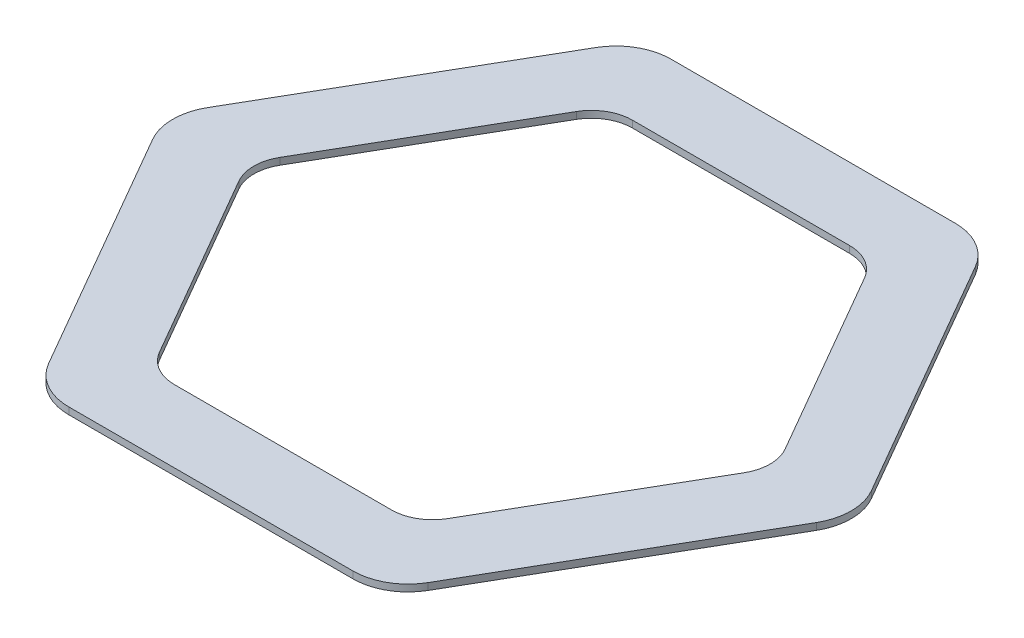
ISO-10303-21;
HEADER;
FILE_DESCRIPTION(('STEP AP214'),'2;1');
FILE_NAME('part.step','',(''),(''),'','','');
FILE_SCHEMA(('AUTOMOTIVE_DESIGN { 1 0 10303 214 1 1 1 1 }'));
ENDSEC;
DATA;
#1=APPLICATION_CONTEXT('core data for automotive mechanical design processes');
#2=APPLICATION_PROTOCOL_DEFINITION('international standard','automotive_design',2000,#1);
#3=PRODUCT_CONTEXT('',#1,'mechanical');
#4=PRODUCT('Part','Part','',(#3));
#5=PRODUCT_RELATED_PRODUCT_CATEGORY('part','',(#4));
#6=PRODUCT_DEFINITION_FORMATION('','',#4);
#7=PRODUCT_DEFINITION_CONTEXT('part definition',#1,'design');
#8=PRODUCT_DEFINITION('design','',#6,#7);
#9=PRODUCT_DEFINITION_SHAPE('','',#8);
#10=(LENGTH_UNIT() NAMED_UNIT(*) SI_UNIT(.MILLI.,.METRE.));
#11=(NAMED_UNIT(*) PLANE_ANGLE_UNIT() SI_UNIT($,.RADIAN.));
#12=(NAMED_UNIT(*) SI_UNIT($,.STERADIAN.) SOLID_ANGLE_UNIT());
#13=UNCERTAINTY_MEASURE_WITH_UNIT(LENGTH_MEASURE(1.E-05),#10,'distance_accuracy_value','');
#14=(GEOMETRIC_REPRESENTATION_CONTEXT(3) GLOBAL_UNCERTAINTY_ASSIGNED_CONTEXT((#13)) GLOBAL_UNIT_ASSIGNED_CONTEXT((#10,
#11,#12)) REPRESENTATION_CONTEXT('',''));
#15=CARTESIAN_POINT('',(0.,0.,0.));
#16=DIRECTION('',(0.,0.,1.));
#17=DIRECTION('',(1.,0.,0.));
#18=AXIS2_PLACEMENT_3D('',#15,#16,#17);
#19=CARTESIAN_POINT('',(-41.569219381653,2.,-72.));
#20=DIRECTION('',(0.,1.,0.));
#21=DIRECTION('',(0.,0.,1.));
#22=AXIS2_PLACEMENT_3D('',#19,#20,#21);
#23=PLANE('',#22);
#24=CARTESIAN_POINT('',(-41.569219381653,2.,-72.));
#25=DIRECTION('',(0.,1.,0.));
#26=DIRECTION('',(0.,0.,1.));
#27=AXIS2_PLACEMENT_3D('',#24,#25,#26);
#28=CIRCLE('',#27,16.1);
#29=CARTESIAN_POINT('',(-41.569219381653,2.,-88.1));
#30=VERTEX_POINT('',#29);
#31=CARTESIAN_POINT('',(-55.5122283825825,2.,-80.05));
#32=VERTEX_POINT('',#31);
#33=EDGE_CURVE('E293',#30,#32,#28,.T.);
#34=ORIENTED_EDGE('',*,*,#33,.T.);
#35=DIRECTION('',(-0.5,0.,0.866025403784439));
#36=VECTOR('',#35,1.);
#37=CARTESIAN_POINT('',(-55.5122283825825,2.,-80.05));
#38=LINE('',#37,#36);
#39=CARTESIAN_POINT('',(-97.0814477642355,2.,-8.04999999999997));
#40=VERTEX_POINT('',#39);
#41=EDGE_CURVE('E296',#32,#40,#38,.T.);
#42=ORIENTED_EDGE('',*,*,#41,.T.);
#43=CARTESIAN_POINT('',(-83.1384387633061,2.,0.));
#44=DIRECTION('',(0.,1.,0.));
#45=DIRECTION('',(0.,0.,1.));
#46=AXIS2_PLACEMENT_3D('',#43,#44,#45);
#47=CIRCLE('',#46,16.1);
#48=CARTESIAN_POINT('',(-97.0814477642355,2.,8.05000000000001));
#49=VERTEX_POINT('',#48);
#50=EDGE_CURVE('E299',#40,#49,#47,.T.);
#51=ORIENTED_EDGE('',*,*,#50,.T.);
#52=DIRECTION('',(0.5,0.,0.866025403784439));
#53=VECTOR('',#52,1.);
#54=CARTESIAN_POINT('',(-97.0814477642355,2.,8.05000000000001));
#55=LINE('',#54,#53);
#56=CARTESIAN_POINT('',(-55.5122283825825,2.,80.05));
#57=VERTEX_POINT('',#56);
#58=EDGE_CURVE('E301',#49,#57,#55,.T.);
#59=ORIENTED_EDGE('',*,*,#58,.T.);
#60=CARTESIAN_POINT('',(-41.569219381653,2.,72.));
#61=DIRECTION('',(0.,1.,0.));
#62=DIRECTION('',(0.,0.,1.));
#63=AXIS2_PLACEMENT_3D('',#60,#61,#62);
#64=CIRCLE('',#63,16.1);
#65=CARTESIAN_POINT('',(-41.569219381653,2.,88.1));
#66=VERTEX_POINT('',#65);
#67=EDGE_CURVE('E303',#57,#66,#64,.T.);
#68=ORIENTED_EDGE('',*,*,#67,.T.);
#69=DIRECTION('',(1.,0.,0.));
#70=VECTOR('',#69,1.);
#71=CARTESIAN_POINT('',(-41.569219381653,2.,88.1));
#72=LINE('',#71,#70);
#73=CARTESIAN_POINT('',(41.569219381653,2.,88.1));
#74=VERTEX_POINT('',#73);
#75=EDGE_CURVE('E305',#66,#74,#72,.T.);
#76=ORIENTED_EDGE('',*,*,#75,.T.);
#77=CARTESIAN_POINT('',(41.569219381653,2.,72.));
#78=DIRECTION('',(0.,1.,0.));
#79=DIRECTION('',(0.,0.,1.));
#80=AXIS2_PLACEMENT_3D('',#77,#78,#79);
#81=CIRCLE('',#80,16.1);
#82=CARTESIAN_POINT('',(55.5122283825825,2.,80.05));
#83=VERTEX_POINT('',#82);
#84=EDGE_CURVE('E307',#74,#83,#81,.T.);
#85=ORIENTED_EDGE('',*,*,#84,.T.);
#86=DIRECTION('',(0.5,0.,-0.866025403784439));
#87=VECTOR('',#86,1.);
#88=CARTESIAN_POINT('',(55.5122283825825,2.,80.05));
#89=LINE('',#88,#87);
#90=CARTESIAN_POINT('',(97.0814477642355,2.,8.0499999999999));
#91=VERTEX_POINT('',#90);
#92=EDGE_CURVE('E309',#83,#91,#89,.T.);
#93=ORIENTED_EDGE('',*,*,#92,.T.);
#94=CARTESIAN_POINT('',(83.1384387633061,2.,0.));
#95=DIRECTION('',(0.,1.,0.));
#96=DIRECTION('',(0.,0.,-1.));
#97=AXIS2_PLACEMENT_3D('',#94,#95,#96);
#98=CIRCLE('',#97,16.1);
#99=CARTESIAN_POINT('',(97.0814477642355,2.,-8.05000000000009));
#100=VERTEX_POINT('',#99);
#101=EDGE_CURVE('E311',#91,#100,#98,.T.);
#102=ORIENTED_EDGE('',*,*,#101,.T.);
#103=DIRECTION('',(-0.5,0.,-0.866025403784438));
#104=VECTOR('',#103,1.);
#105=CARTESIAN_POINT('',(97.0814477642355,2.,-8.05000000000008));
#106=LINE('',#105,#104);
#107=CARTESIAN_POINT('',(55.5122283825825,2.,-80.05));
#108=VERTEX_POINT('',#107);
#109=EDGE_CURVE('E313',#100,#108,#106,.T.);
#110=ORIENTED_EDGE('',*,*,#109,.T.);
#111=CARTESIAN_POINT('',(41.569219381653,2.,-72.));
#112=DIRECTION('',(0.,1.,0.));
#113=DIRECTION('',(0.,0.,1.));
#114=AXIS2_PLACEMENT_3D('',#111,#112,#113);
#115=CIRCLE('',#114,16.1);
#116=CARTESIAN_POINT('',(41.569219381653,2.,-88.1));
#117=VERTEX_POINT('',#116);
#118=EDGE_CURVE('E315',#108,#117,#115,.T.);
#119=ORIENTED_EDGE('',*,*,#118,.T.);
#120=DIRECTION('',(-1.,0.,0.));
#121=VECTOR('',#120,1.);
#122=CARTESIAN_POINT('',(41.569219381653,2.,-88.1));
#123=LINE('',#122,#121);
#124=EDGE_CURVE('E317',#117,#30,#123,.T.);
#125=ORIENTED_EDGE('',*,*,#124,.T.);
#126=EDGE_LOOP('',(#34,#42,#51,#59,#68,#76,#85,#93,#102,#110,#119,#125));
#127=FACE_BOUND('',#126,.T.);
#128=DIRECTION('',(-0.5,0.,0.866025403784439));
#129=VECTOR('',#128,1.);
#130=CARTESIAN_POINT('',(-42.1465696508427,2.,-61.));
#131=LINE('',#130,#129);
#132=CARTESIAN_POINT('',(-42.1465696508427,2.,-61.));
#133=VERTEX_POINT('',#132);
#134=CARTESIAN_POINT('',(-73.9008344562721,2.,-5.99999999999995));
#135=VERTEX_POINT('',#134);
#136=EDGE_CURVE('E208',#133,#135,#131,.T.);
#137=ORIENTED_EDGE('',*,*,#136,.F.);
#138=CARTESIAN_POINT('',(-31.7542648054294,2.,-55.));
#139=DIRECTION('',(0.,1.,0.));
#140=DIRECTION('',(0.,0.,1.));
#141=AXIS2_PLACEMENT_3D('',#138,#139,#140);
#142=CIRCLE('',#141,12.);
#143=CARTESIAN_POINT('',(-31.7542648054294,2.,-67.));
#144=VERTEX_POINT('',#143);
#145=EDGE_CURVE('E200',#144,#133,#142,.T.);
#146=ORIENTED_EDGE('',*,*,#145,.F.);
#147=DIRECTION('',(-1.,0.,0.));
#148=VECTOR('',#147,1.);
#149=CARTESIAN_POINT('',(31.7542648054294,2.,-67.));
#150=LINE('',#149,#148);
#151=CARTESIAN_POINT('',(31.7542648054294,2.,-67.));
#152=VERTEX_POINT('',#151);
#153=EDGE_CURVE('E241',#152,#144,#150,.T.);
#154=ORIENTED_EDGE('',*,*,#153,.F.);
#155=CARTESIAN_POINT('',(31.7542648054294,2.,-55.));
#156=DIRECTION('',(0.,1.,0.));
#157=DIRECTION('',(0.,0.,1.));
#158=AXIS2_PLACEMENT_3D('',#155,#156,#157);
#159=CIRCLE('',#158,12.);
#160=CARTESIAN_POINT('',(42.1465696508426,2.,-61.));
#161=VERTEX_POINT('',#160);
#162=EDGE_CURVE('E239',#161,#152,#159,.T.);
#163=ORIENTED_EDGE('',*,*,#162,.F.);
#164=DIRECTION('',(-0.5,0.,-0.866025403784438));
#165=VECTOR('',#164,1.);
#166=CARTESIAN_POINT('',(73.9008344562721,2.,-6.00000000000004));
#167=LINE('',#166,#165);
#168=CARTESIAN_POINT('',(73.9008344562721,2.,-6.00000000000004));
#169=VERTEX_POINT('',#168);
#170=EDGE_CURVE('E237',#169,#161,#167,.T.);
#171=ORIENTED_EDGE('',*,*,#170,.F.);
#172=CARTESIAN_POINT('',(63.5085296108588,2.,0.));
#173=DIRECTION('',(0.,1.,0.));
#174=DIRECTION('',(0.,0.,-1.));
#175=AXIS2_PLACEMENT_3D('',#172,#173,#174);
#176=CIRCLE('',#175,12.);
#177=CARTESIAN_POINT('',(73.9008344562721,2.,5.99999999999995));
#178=VERTEX_POINT('',#177);
#179=EDGE_CURVE('E235',#178,#169,#176,.T.);
#180=ORIENTED_EDGE('',*,*,#179,.F.);
#181=DIRECTION('',(0.499999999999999,0.,-0.866025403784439));
#182=VECTOR('',#181,1.);
#183=CARTESIAN_POINT('',(42.1465696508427,2.,61.));
#184=LINE('',#183,#182);
#185=CARTESIAN_POINT('',(42.1465696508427,2.,61.));
#186=VERTEX_POINT('',#185);
#187=EDGE_CURVE('E233',#186,#178,#184,.T.);
#188=ORIENTED_EDGE('',*,*,#187,.F.);
#189=CARTESIAN_POINT('',(31.7542648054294,2.,55.));
#190=DIRECTION('',(0.,1.,0.));
#191=DIRECTION('',(0.,0.,1.));
#192=AXIS2_PLACEMENT_3D('',#189,#190,#191);
#193=CIRCLE('',#192,12.);
#194=CARTESIAN_POINT('',(31.7542648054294,2.,67.));
#195=VERTEX_POINT('',#194);
#196=EDGE_CURVE('E231',#195,#186,#193,.T.);
#197=ORIENTED_EDGE('',*,*,#196,.F.);
#198=DIRECTION('',(1.,0.,0.));
#199=VECTOR('',#198,1.);
#200=CARTESIAN_POINT('',(-31.7542648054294,2.,67.));
#201=LINE('',#200,#199);
#202=CARTESIAN_POINT('',(-31.7542648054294,2.,67.));
#203=VERTEX_POINT('',#202);
#204=EDGE_CURVE('E229',#203,#195,#201,.T.);
#205=ORIENTED_EDGE('',*,*,#204,.F.);
#206=CARTESIAN_POINT('',(-31.7542648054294,2.,55.));
#207=DIRECTION('',(0.,1.,0.));
#208=DIRECTION('',(0.,0.,1.));
#209=AXIS2_PLACEMENT_3D('',#206,#207,#208);
#210=CIRCLE('',#209,12.);
#211=CARTESIAN_POINT('',(-42.1465696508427,2.,61.));
#212=VERTEX_POINT('',#211);
#213=EDGE_CURVE('E227',#212,#203,#210,.T.);
#214=ORIENTED_EDGE('',*,*,#213,.F.);
#215=DIRECTION('',(0.5,0.,0.866025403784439));
#216=VECTOR('',#215,1.);
#217=CARTESIAN_POINT('',(-73.9008344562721,2.,6.00000000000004));
#218=LINE('',#217,#216);
#219=CARTESIAN_POINT('',(-73.9008344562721,2.,6.00000000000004));
#220=VERTEX_POINT('',#219);
#221=EDGE_CURVE('E223',#220,#212,#218,.T.);
#222=ORIENTED_EDGE('',*,*,#221,.F.);
#223=CARTESIAN_POINT('',(-63.5085296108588,2.,0.));
#224=DIRECTION('',(0.,1.,0.));
#225=DIRECTION('',(0.,0.,1.));
#226=AXIS2_PLACEMENT_3D('',#223,#224,#225);
#227=CIRCLE('',#226,12.);
#228=EDGE_CURVE('E221',#135,#220,#227,.T.);
#229=ORIENTED_EDGE('',*,*,#228,.F.);
#230=EDGE_LOOP('',(#137,#146,#154,#163,#171,#180,#188,#197,#205,#214,#222,#229));
#231=FACE_BOUND('',#230,.T.);
#232=ADVANCED_FACE('F39',(#127,#231),#23,.T.);
#233=CARTESIAN_POINT('',(-41.569219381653,0.,-72.));
#234=DIRECTION('',(0.,1.,0.));
#235=DIRECTION('',(0.,0.,1.));
#236=AXIS2_PLACEMENT_3D('',#233,#234,#235);
#237=PLANE('',#236);
#238=CARTESIAN_POINT('',(-41.569219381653,0.,-72.));
#239=DIRECTION('',(0.,1.,0.));
#240=DIRECTION('',(0.,0.,1.));
#241=AXIS2_PLACEMENT_3D('',#238,#239,#240);
#242=CIRCLE('',#241,16.1);
#243=CARTESIAN_POINT('',(-41.569219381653,0.,-88.1));
#244=VERTEX_POINT('',#243);
#245=CARTESIAN_POINT('',(-55.5122283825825,0.,-80.05));
#246=VERTEX_POINT('',#245);
#247=EDGE_CURVE('E216',#244,#246,#242,.T.);
#248=ORIENTED_EDGE('',*,*,#247,.F.);
#249=DIRECTION('',(-1.,0.,0.));
#250=VECTOR('',#249,1.);
#251=CARTESIAN_POINT('',(41.569219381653,0.,-88.1));
#252=LINE('',#251,#250);
#253=CARTESIAN_POINT('',(41.569219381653,0.,-88.1));
#254=VERTEX_POINT('',#253);
#255=EDGE_CURVE('E297',#254,#244,#252,.T.);
#256=ORIENTED_EDGE('',*,*,#255,.F.);
#257=CARTESIAN_POINT('',(41.569219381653,0.,-72.));
#258=DIRECTION('',(0.,1.,0.));
#259=DIRECTION('',(0.,0.,1.));
#260=AXIS2_PLACEMENT_3D('',#257,#258,#259);
#261=CIRCLE('',#260,16.1);
#262=CARTESIAN_POINT('',(55.5122283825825,0.,-80.05));
#263=VERTEX_POINT('',#262);
#264=EDGE_CURVE('E340',#263,#254,#261,.T.);
#265=ORIENTED_EDGE('',*,*,#264,.F.);
#266=DIRECTION('',(-0.5,0.,-0.866025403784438));
#267=VECTOR('',#266,1.);
#268=CARTESIAN_POINT('',(97.0814477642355,0.,-8.05000000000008));
#269=LINE('',#268,#267);
#270=CARTESIAN_POINT('',(97.0814477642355,0.,-8.05000000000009));
#271=VERTEX_POINT('',#270);
#272=EDGE_CURVE('E338',#271,#263,#269,.T.);
#273=ORIENTED_EDGE('',*,*,#272,.F.);
#274=CARTESIAN_POINT('',(83.1384387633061,0.,0.));
#275=DIRECTION('',(0.,1.,0.));
#276=DIRECTION('',(0.,0.,-1.));
#277=AXIS2_PLACEMENT_3D('',#274,#275,#276);
#278=CIRCLE('',#277,16.1);
#279=CARTESIAN_POINT('',(97.0814477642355,0.,8.0499999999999));
#280=VERTEX_POINT('',#279);
#281=EDGE_CURVE('E336',#280,#271,#278,.T.);
#282=ORIENTED_EDGE('',*,*,#281,.F.);
#283=DIRECTION('',(0.5,0.,-0.866025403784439));
#284=VECTOR('',#283,1.);
#285=CARTESIAN_POINT('',(55.5122283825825,0.,80.05));
#286=LINE('',#285,#284);
#287=CARTESIAN_POINT('',(55.5122283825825,0.,80.05));
#288=VERTEX_POINT('',#287);
#289=EDGE_CURVE('E334',#288,#280,#286,.T.);
#290=ORIENTED_EDGE('',*,*,#289,.F.);
#291=CARTESIAN_POINT('',(41.569219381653,0.,72.));
#292=DIRECTION('',(0.,1.,0.));
#293=DIRECTION('',(0.,0.,1.));
#294=AXIS2_PLACEMENT_3D('',#291,#292,#293);
#295=CIRCLE('',#294,16.1);
#296=CARTESIAN_POINT('',(41.569219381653,0.,88.1));
#297=VERTEX_POINT('',#296);
#298=EDGE_CURVE('E332',#297,#288,#295,.T.);
#299=ORIENTED_EDGE('',*,*,#298,.F.);
#300=DIRECTION('',(1.,0.,0.));
#301=VECTOR('',#300,1.);
#302=CARTESIAN_POINT('',(-41.569219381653,0.,88.1));
#303=LINE('',#302,#301);
#304=CARTESIAN_POINT('',(-41.569219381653,0.,88.1));
#305=VERTEX_POINT('',#304);
#306=EDGE_CURVE('E330',#305,#297,#303,.T.);
#307=ORIENTED_EDGE('',*,*,#306,.F.);
#308=CARTESIAN_POINT('',(-41.569219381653,0.,72.));
#309=DIRECTION('',(0.,1.,0.));
#310=DIRECTION('',(0.,0.,1.));
#311=AXIS2_PLACEMENT_3D('',#308,#309,#310);
#312=CIRCLE('',#311,16.1);
#313=CARTESIAN_POINT('',(-55.5122283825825,0.,80.05));
#314=VERTEX_POINT('',#313);
#315=EDGE_CURVE('E328',#314,#305,#312,.T.);
#316=ORIENTED_EDGE('',*,*,#315,.F.);
#317=DIRECTION('',(0.5,0.,0.866025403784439));
#318=VECTOR('',#317,1.);
#319=CARTESIAN_POINT('',(-97.0814477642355,0.,8.05000000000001));
#320=LINE('',#319,#318);
#321=CARTESIAN_POINT('',(-97.0814477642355,0.,8.05000000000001));
#322=VERTEX_POINT('',#321);
#323=EDGE_CURVE('E326',#322,#314,#320,.T.);
#324=ORIENTED_EDGE('',*,*,#323,.F.);
#325=CARTESIAN_POINT('',(-83.1384387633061,0.,0.));
#326=DIRECTION('',(0.,1.,0.));
#327=DIRECTION('',(0.,0.,1.));
#328=AXIS2_PLACEMENT_3D('',#325,#326,#327);
#329=CIRCLE('',#328,16.1);
#330=CARTESIAN_POINT('',(-97.0814477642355,0.,-8.04999999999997));
#331=VERTEX_POINT('',#330);
#332=EDGE_CURVE('E324',#331,#322,#329,.T.);
#333=ORIENTED_EDGE('',*,*,#332,.F.);
#334=DIRECTION('',(-0.5,0.,0.866025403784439));
#335=VECTOR('',#334,1.);
#336=CARTESIAN_POINT('',(-55.5122283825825,0.,-80.05));
#337=LINE('',#336,#335);
#338=EDGE_CURVE('E322',#246,#331,#337,.T.);
#339=ORIENTED_EDGE('',*,*,#338,.F.);
#340=EDGE_LOOP('',(#248,#256,#265,#273,#282,#290,#299,#307,#316,#324,#333,#339));
#341=FACE_BOUND('',#340,.T.);
#342=CARTESIAN_POINT('',(-31.7542648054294,0.,-55.));
#343=DIRECTION('',(0.,1.,0.));
#344=DIRECTION('',(0.,0.,1.));
#345=AXIS2_PLACEMENT_3D('',#342,#343,#344);
#346=CIRCLE('',#345,12.);
#347=CARTESIAN_POINT('',(-31.7542648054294,0.,-67.));
#348=VERTEX_POINT('',#347);
#349=CARTESIAN_POINT('',(-42.1465696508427,0.,-61.));
#350=VERTEX_POINT('',#349);
#351=EDGE_CURVE('E62',#348,#350,#346,.T.);
#352=ORIENTED_EDGE('',*,*,#351,.T.);
#353=DIRECTION('',(-0.5,0.,0.866025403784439));
#354=VECTOR('',#353,1.);
#355=CARTESIAN_POINT('',(-42.1465696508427,0.,-61.));
#356=LINE('',#355,#354);
#357=CARTESIAN_POINT('',(-73.9008344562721,0.,-5.99999999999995));
#358=VERTEX_POINT('',#357);
#359=EDGE_CURVE('E215',#350,#358,#356,.T.);
#360=ORIENTED_EDGE('',*,*,#359,.T.);
#361=CARTESIAN_POINT('',(-63.5085296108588,0.,0.));
#362=DIRECTION('',(0.,1.,0.));
#363=DIRECTION('',(0.,0.,1.));
#364=AXIS2_PLACEMENT_3D('',#361,#362,#363);
#365=CIRCLE('',#364,12.);
#366=CARTESIAN_POINT('',(-73.9008344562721,0.,6.00000000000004));
#367=VERTEX_POINT('',#366);
#368=EDGE_CURVE('E245',#358,#367,#365,.T.);
#369=ORIENTED_EDGE('',*,*,#368,.T.);
#370=DIRECTION('',(0.5,0.,0.866025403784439));
#371=VECTOR('',#370,1.);
#372=CARTESIAN_POINT('',(-73.9008344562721,0.,6.00000000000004));
#373=LINE('',#372,#371);
#374=CARTESIAN_POINT('',(-42.1465696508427,0.,61.));
#375=VERTEX_POINT('',#374);
#376=EDGE_CURVE('E248',#367,#375,#373,.T.);
#377=ORIENTED_EDGE('',*,*,#376,.T.);
#378=CARTESIAN_POINT('',(-31.7542648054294,0.,55.));
#379=DIRECTION('',(0.,1.,0.));
#380=DIRECTION('',(0.,0.,1.));
#381=AXIS2_PLACEMENT_3D('',#378,#379,#380);
#382=CIRCLE('',#381,12.);
#383=CARTESIAN_POINT('',(-31.7542648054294,0.,67.));
#384=VERTEX_POINT('',#383);
#385=EDGE_CURVE('E251',#375,#384,#382,.T.);
#386=ORIENTED_EDGE('',*,*,#385,.T.);
#387=DIRECTION('',(1.,0.,0.));
#388=VECTOR('',#387,1.);
#389=CARTESIAN_POINT('',(-31.7542648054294,0.,67.));
#390=LINE('',#389,#388);
#391=CARTESIAN_POINT('',(31.7542648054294,0.,67.));
#392=VERTEX_POINT('',#391);
#393=EDGE_CURVE('E254',#384,#392,#390,.T.);
#394=ORIENTED_EDGE('',*,*,#393,.T.);
#395=CARTESIAN_POINT('',(31.7542648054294,0.,55.));
#396=DIRECTION('',(0.,1.,0.));
#397=DIRECTION('',(0.,0.,1.));
#398=AXIS2_PLACEMENT_3D('',#395,#396,#397);
#399=CIRCLE('',#398,12.);
#400=CARTESIAN_POINT('',(42.1465696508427,0.,61.));
#401=VERTEX_POINT('',#400);
#402=EDGE_CURVE('E257',#392,#401,#399,.T.);
#403=ORIENTED_EDGE('',*,*,#402,.T.);
#404=DIRECTION('',(0.499999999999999,0.,-0.866025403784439));
#405=VECTOR('',#404,1.);
#406=CARTESIAN_POINT('',(42.1465696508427,0.,61.));
#407=LINE('',#406,#405);
#408=CARTESIAN_POINT('',(73.9008344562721,0.,5.99999999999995));
#409=VERTEX_POINT('',#408);
#410=EDGE_CURVE('E260',#401,#409,#407,.T.);
#411=ORIENTED_EDGE('',*,*,#410,.T.);
#412=CARTESIAN_POINT('',(63.5085296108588,0.,0.));
#413=DIRECTION('',(0.,1.,0.));
#414=DIRECTION('',(0.,0.,-1.));
#415=AXIS2_PLACEMENT_3D('',#412,#413,#414);
#416=CIRCLE('',#415,12.);
#417=CARTESIAN_POINT('',(73.9008344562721,0.,-6.00000000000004));
#418=VERTEX_POINT('',#417);
#419=EDGE_CURVE('E263',#409,#418,#416,.T.);
#420=ORIENTED_EDGE('',*,*,#419,.T.);
#421=DIRECTION('',(-0.5,0.,-0.866025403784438));
#422=VECTOR('',#421,1.);
#423=CARTESIAN_POINT('',(73.9008344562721,0.,-6.00000000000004));
#424=LINE('',#423,#422);
#425=CARTESIAN_POINT('',(42.1465696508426,0.,-61.));
#426=VERTEX_POINT('',#425);
#427=EDGE_CURVE('E266',#418,#426,#424,.T.);
#428=ORIENTED_EDGE('',*,*,#427,.T.);
#429=CARTESIAN_POINT('',(31.7542648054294,0.,-55.));
#430=DIRECTION('',(0.,1.,0.));
#431=DIRECTION('',(0.,0.,1.));
#432=AXIS2_PLACEMENT_3D('',#429,#430,#431);
#433=CIRCLE('',#432,12.);
#434=CARTESIAN_POINT('',(31.7542648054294,0.,-67.));
#435=VERTEX_POINT('',#434);
#436=EDGE_CURVE('E269',#426,#435,#433,.T.);
#437=ORIENTED_EDGE('',*,*,#436,.T.);
#438=DIRECTION('',(-1.,0.,0.));
#439=VECTOR('',#438,1.);
#440=CARTESIAN_POINT('',(31.7542648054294,0.,-67.));
#441=LINE('',#440,#439);
#442=EDGE_CURVE('E209',#435,#348,#441,.T.);
#443=ORIENTED_EDGE('',*,*,#442,.T.);
#444=EDGE_LOOP('',(#352,#360,#369,#377,#386,#394,#403,#411,#420,#428,#437,#443));
#445=FACE_BOUND('',#444,.T.);
#446=ADVANCED_FACE('F382',(#341,#445),#237,.F.);
#447=CARTESIAN_POINT('',(-41.569219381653,2.,-72.));
#448=DIRECTION('',(0.,-1.,0.));
#449=DIRECTION('',(0.,0.,-1.));
#450=AXIS2_PLACEMENT_3D('',#447,#448,#449);
#451=CYLINDRICAL_SURFACE('',#450,16.1);
#452=ORIENTED_EDGE('',*,*,#247,.T.);
#453=DIRECTION('',(0.,-1.,0.));
#454=VECTOR('',#453,1.);
#455=CARTESIAN_POINT('',(-55.5122283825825,2.,-80.05));
#456=LINE('',#455,#454);
#457=EDGE_CURVE('E11',#32,#246,#456,.T.);
#458=ORIENTED_EDGE('',*,*,#457,.F.);
#459=ORIENTED_EDGE('',*,*,#33,.F.);
#460=DIRECTION('',(0.,-1.,0.));
#461=VECTOR('',#460,1.);
#462=CARTESIAN_POINT('',(-41.569219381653,2.,-88.1));
#463=LINE('',#462,#461);
#464=EDGE_CURVE('E319',#30,#244,#463,.T.);
#465=ORIENTED_EDGE('',*,*,#464,.T.);
#466=EDGE_LOOP('',(#452,#458,#459,#465));
#467=FACE_BOUND('',#466,.T.);
#468=ADVANCED_FACE('F41',(#467),#451,.T.);
#469=CARTESIAN_POINT('',(-55.5122283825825,2.,-80.05));
#470=DIRECTION('',(0.866025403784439,0.,0.5));
#471=DIRECTION('',(0.5,0.,-0.866025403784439));
#472=AXIS2_PLACEMENT_3D('',#469,#470,#471);
#473=PLANE('',#472);
#474=ORIENTED_EDGE('',*,*,#338,.T.);
#475=DIRECTION('',(0.,-1.,0.));
#476=VECTOR('',#475,1.);
#477=CARTESIAN_POINT('',(-97.0814477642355,2.,-8.04999999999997));
#478=LINE('',#477,#476);
#479=EDGE_CURVE('E47',#40,#331,#478,.T.);
#480=ORIENTED_EDGE('',*,*,#479,.F.);
#481=ORIENTED_EDGE('',*,*,#41,.F.);
#482=ORIENTED_EDGE('',*,*,#457,.T.);
#483=EDGE_LOOP('',(#474,#480,#481,#482));
#484=FACE_BOUND('',#483,.T.);
#485=ADVANCED_FACE('F399',(#484),#473,.F.);
#486=CARTESIAN_POINT('',(-83.1384387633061,2.,0.));
#487=DIRECTION('',(0.,-1.,0.));
#488=DIRECTION('',(0.,0.,-1.));
#489=AXIS2_PLACEMENT_3D('',#486,#487,#488);
#490=CYLINDRICAL_SURFACE('',#489,16.1);
#491=ORIENTED_EDGE('',*,*,#332,.T.);
#492=DIRECTION('',(0.,-1.,0.));
#493=VECTOR('',#492,1.);
#494=CARTESIAN_POINT('',(-97.0814477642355,2.,8.05000000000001));
#495=LINE('',#494,#493);
#496=EDGE_CURVE('E369',#49,#322,#495,.T.);
#497=ORIENTED_EDGE('',*,*,#496,.F.);
#498=ORIENTED_EDGE('',*,*,#50,.F.);
#499=ORIENTED_EDGE('',*,*,#479,.T.);
#500=EDGE_LOOP('',(#491,#497,#498,#499));
#501=FACE_BOUND('',#500,.T.);
#502=ADVANCED_FACE('F376',(#501),#490,.T.);
#503=CARTESIAN_POINT('',(-97.0814477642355,2.,8.05000000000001));
#504=DIRECTION('',(0.866025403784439,0.,-0.5));
#505=DIRECTION('',(-0.5,0.,-0.866025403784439));
#506=AXIS2_PLACEMENT_3D('',#503,#504,#505);
#507=PLANE('',#506);
#508=ORIENTED_EDGE('',*,*,#323,.T.);
#509=DIRECTION('',(0.,-1.,0.));
#510=VECTOR('',#509,1.);
#511=CARTESIAN_POINT('',(-55.5122283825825,2.,80.05));
#512=LINE('',#511,#510);
#513=EDGE_CURVE('E366',#57,#314,#512,.T.);
#514=ORIENTED_EDGE('',*,*,#513,.F.);
#515=ORIENTED_EDGE('',*,*,#58,.F.);
#516=ORIENTED_EDGE('',*,*,#496,.T.);
#517=EDGE_LOOP('',(#508,#514,#515,#516));
#518=FACE_BOUND('',#517,.T.);
#519=ADVANCED_FACE('F388',(#518),#507,.F.);
#520=CARTESIAN_POINT('',(-41.569219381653,2.,72.));
#521=DIRECTION('',(0.,-1.,0.));
#522=DIRECTION('',(0.,0.,-1.));
#523=AXIS2_PLACEMENT_3D('',#520,#521,#522);
#524=CYLINDRICAL_SURFACE('',#523,16.1);
#525=ORIENTED_EDGE('',*,*,#315,.T.);
#526=DIRECTION('',(0.,-1.,0.));
#527=VECTOR('',#526,1.);
#528=CARTESIAN_POINT('',(-41.569219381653,2.,88.1));
#529=LINE('',#528,#527);
#530=EDGE_CURVE('E363',#66,#305,#529,.T.);
#531=ORIENTED_EDGE('',*,*,#530,.F.);
#532=ORIENTED_EDGE('',*,*,#67,.F.);
#533=ORIENTED_EDGE('',*,*,#513,.T.);
#534=EDGE_LOOP('',(#525,#531,#532,#533));
#535=FACE_BOUND('',#534,.T.);
#536=ADVANCED_FACE('F392',(#535),#524,.T.);
#537=CARTESIAN_POINT('',(-41.569219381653,2.,88.1));
#538=DIRECTION('',(0.,0.,-1.));
#539=DIRECTION('',(-1.,0.,0.));
#540=AXIS2_PLACEMENT_3D('',#537,#538,#539);
#541=PLANE('',#540);
#542=ORIENTED_EDGE('',*,*,#306,.T.);
#543=DIRECTION('',(0.,-1.,0.));
#544=VECTOR('',#543,1.);
#545=CARTESIAN_POINT('',(41.569219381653,2.,88.1));
#546=LINE('',#545,#544);
#547=EDGE_CURVE('E360',#74,#297,#546,.T.);
#548=ORIENTED_EDGE('',*,*,#547,.F.);
#549=ORIENTED_EDGE('',*,*,#75,.F.);
#550=ORIENTED_EDGE('',*,*,#530,.T.);
#551=EDGE_LOOP('',(#542,#548,#549,#550));
#552=FACE_BOUND('',#551,.T.);
#553=ADVANCED_FACE('F432',(#552),#541,.F.);
#554=CARTESIAN_POINT('',(41.569219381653,2.,72.));
#555=DIRECTION('',(0.,-1.,0.));
#556=DIRECTION('',(0.,0.,-1.));
#557=AXIS2_PLACEMENT_3D('',#554,#555,#556);
#558=CYLINDRICAL_SURFACE('',#557,16.1);
#559=ORIENTED_EDGE('',*,*,#298,.T.);
#560=DIRECTION('',(0.,-1.,0.));
#561=VECTOR('',#560,1.);
#562=CARTESIAN_POINT('',(55.5122283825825,2.,80.05));
#563=LINE('',#562,#561);
#564=EDGE_CURVE('E357',#83,#288,#563,.T.);
#565=ORIENTED_EDGE('',*,*,#564,.F.);
#566=ORIENTED_EDGE('',*,*,#84,.F.);
#567=ORIENTED_EDGE('',*,*,#547,.T.);
#568=EDGE_LOOP('',(#559,#565,#566,#567));
#569=FACE_BOUND('',#568,.T.);
#570=ADVANCED_FACE('F430',(#569),#558,.T.);
#571=CARTESIAN_POINT('',(55.5122283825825,2.,80.05));
#572=DIRECTION('',(-0.866025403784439,0.,-0.5));
#573=DIRECTION('',(-0.5,0.,0.866025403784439));
#574=AXIS2_PLACEMENT_3D('',#571,#572,#573);
#575=PLANE('',#574);
#576=ORIENTED_EDGE('',*,*,#289,.T.);
#577=DIRECTION('',(0.,-1.,0.));
#578=VECTOR('',#577,1.);
#579=CARTESIAN_POINT('',(97.0814477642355,2.,8.0499999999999));
#580=LINE('',#579,#578);
#581=EDGE_CURVE('E354',#91,#280,#580,.T.);
#582=ORIENTED_EDGE('',*,*,#581,.F.);
#583=ORIENTED_EDGE('',*,*,#92,.F.);
#584=ORIENTED_EDGE('',*,*,#564,.T.);
#585=EDGE_LOOP('',(#576,#582,#583,#584));
#586=FACE_BOUND('',#585,.T.);
#587=ADVANCED_FACE('F426',(#586),#575,.F.);
#588=CARTESIAN_POINT('',(83.1384387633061,2.,0.));
#589=DIRECTION('',(0.,-1.,0.));
#590=DIRECTION('',(0.,0.,-1.));
#591=AXIS2_PLACEMENT_3D('',#588,#589,#590);
#592=CYLINDRICAL_SURFACE('',#591,16.1);
#593=ORIENTED_EDGE('',*,*,#281,.T.);
#594=DIRECTION('',(0.,-1.,0.));
#595=VECTOR('',#594,1.);
#596=CARTESIAN_POINT('',(97.0814477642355,2.,-8.05000000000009));
#597=LINE('',#596,#595);
#598=EDGE_CURVE('E351',#100,#271,#597,.T.);
#599=ORIENTED_EDGE('',*,*,#598,.F.);
#600=ORIENTED_EDGE('',*,*,#101,.F.);
#601=ORIENTED_EDGE('',*,*,#581,.T.);
#602=EDGE_LOOP('',(#593,#599,#600,#601));
#603=FACE_BOUND('',#602,.T.);
#604=ADVANCED_FACE('F421',(#603),#592,.T.);
#605=CARTESIAN_POINT('',(97.0814477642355,2.,-8.05000000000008));
#606=DIRECTION('',(-0.866025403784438,0.,0.5));
#607=DIRECTION('',(0.5,0.,0.866025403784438));
#608=AXIS2_PLACEMENT_3D('',#605,#606,#607);
#609=PLANE('',#608);
#610=ORIENTED_EDGE('',*,*,#272,.T.);
#611=DIRECTION('',(0.,-1.,0.));
#612=VECTOR('',#611,1.);
#613=CARTESIAN_POINT('',(55.5122283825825,2.,-80.05));
#614=LINE('',#613,#612);
#615=EDGE_CURVE('E348',#108,#263,#614,.T.);
#616=ORIENTED_EDGE('',*,*,#615,.F.);
#617=ORIENTED_EDGE('',*,*,#109,.F.);
#618=ORIENTED_EDGE('',*,*,#598,.T.);
#619=EDGE_LOOP('',(#610,#616,#617,#618));
#620=FACE_BOUND('',#619,.T.);
#621=ADVANCED_FACE('F415',(#620),#609,.F.);
#622=CARTESIAN_POINT('',(41.569219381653,2.,-72.));
#623=DIRECTION('',(0.,-1.,0.));
#624=DIRECTION('',(0.,0.,-1.));
#625=AXIS2_PLACEMENT_3D('',#622,#623,#624);
#626=CYLINDRICAL_SURFACE('',#625,16.1);
#627=ORIENTED_EDGE('',*,*,#264,.T.);
#628=DIRECTION('',(0.,-1.,0.));
#629=VECTOR('',#628,1.);
#630=CARTESIAN_POINT('',(41.569219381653,2.,-88.1));
#631=LINE('',#630,#629);
#632=EDGE_CURVE('E345',#117,#254,#631,.T.);
#633=ORIENTED_EDGE('',*,*,#632,.F.);
#634=ORIENTED_EDGE('',*,*,#118,.F.);
#635=ORIENTED_EDGE('',*,*,#615,.T.);
#636=EDGE_LOOP('',(#627,#633,#634,#635));
#637=FACE_BOUND('',#636,.T.);
#638=ADVANCED_FACE('F411',(#637),#626,.T.);
#639=CARTESIAN_POINT('',(41.569219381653,2.,-88.1));
#640=DIRECTION('',(0.,0.,1.));
#641=DIRECTION('',(1.,0.,0.));
#642=AXIS2_PLACEMENT_3D('',#639,#640,#641);
#643=PLANE('',#642);
#644=ORIENTED_EDGE('',*,*,#255,.T.);
#645=ORIENTED_EDGE('',*,*,#464,.F.);
#646=ORIENTED_EDGE('',*,*,#124,.F.);
#647=ORIENTED_EDGE('',*,*,#632,.T.);
#648=EDGE_LOOP('',(#644,#645,#646,#647));
#649=FACE_BOUND('',#648,.T.);
#650=ADVANCED_FACE('F406',(#649),#643,.F.);
#651=CARTESIAN_POINT('',(-31.7542648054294,2.,-55.));
#652=DIRECTION('',(0.,-1.,0.));
#653=DIRECTION('',(0.,0.,-1.));
#654=AXIS2_PLACEMENT_3D('',#651,#652,#653);
#655=CYLINDRICAL_SURFACE('',#654,12.);
#656=ORIENTED_EDGE('',*,*,#351,.F.);
#657=DIRECTION('',(0.,-1.,0.));
#658=VECTOR('',#657,1.);
#659=CARTESIAN_POINT('',(-31.7542648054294,2.,-67.));
#660=LINE('',#659,#658);
#661=EDGE_CURVE('E204',#144,#348,#660,.T.);
#662=ORIENTED_EDGE('',*,*,#661,.F.);
#663=ORIENTED_EDGE('',*,*,#145,.T.);
#664=DIRECTION('',(0.,-1.,0.));
#665=VECTOR('',#664,1.);
#666=CARTESIAN_POINT('',(-42.1465696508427,2.,-61.));
#667=LINE('',#666,#665);
#668=EDGE_CURVE('E203',#133,#350,#667,.T.);
#669=ORIENTED_EDGE('',*,*,#668,.T.);
#670=EDGE_LOOP('',(#656,#662,#663,#669));
#671=FACE_BOUND('',#670,.T.);
#672=ADVANCED_FACE('F202',(#671),#655,.F.);
#673=CARTESIAN_POINT('',(-42.1465696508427,2.,-61.));
#674=DIRECTION('',(0.866025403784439,0.,0.5));
#675=DIRECTION('',(0.5,0.,-0.866025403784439));
#676=AXIS2_PLACEMENT_3D('',#673,#674,#675);
#677=PLANE('',#676);
#678=ORIENTED_EDGE('',*,*,#359,.F.);
#679=ORIENTED_EDGE('',*,*,#668,.F.);
#680=ORIENTED_EDGE('',*,*,#136,.T.);
#681=DIRECTION('',(0.,-1.,0.));
#682=VECTOR('',#681,1.);
#683=CARTESIAN_POINT('',(-73.9008344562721,2.,-5.99999999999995));
#684=LINE('',#683,#682);
#685=EDGE_CURVE('E217',#135,#358,#684,.T.);
#686=ORIENTED_EDGE('',*,*,#685,.T.);
#687=EDGE_LOOP('',(#678,#679,#680,#686));
#688=FACE_BOUND('',#687,.T.);
#689=ADVANCED_FACE('F212',(#688),#677,.T.);
#690=CARTESIAN_POINT('',(-63.5085296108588,2.,0.));
#691=DIRECTION('',(0.,-1.,0.));
#692=DIRECTION('',(0.,0.,-1.));
#693=AXIS2_PLACEMENT_3D('',#690,#691,#692);
#694=CYLINDRICAL_SURFACE('',#693,12.);
#695=ORIENTED_EDGE('',*,*,#368,.F.);
#696=ORIENTED_EDGE('',*,*,#685,.F.);
#697=ORIENTED_EDGE('',*,*,#228,.T.);
#698=DIRECTION('',(0.,-1.,0.));
#699=VECTOR('',#698,1.);
#700=CARTESIAN_POINT('',(-73.9008344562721,2.,6.00000000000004));
#701=LINE('',#700,#699);
#702=EDGE_CURVE('E290',#220,#367,#701,.T.);
#703=ORIENTED_EDGE('',*,*,#702,.T.);
#704=EDGE_LOOP('',(#695,#696,#697,#703));
#705=FACE_BOUND('',#704,.T.);
#706=ADVANCED_FACE('F490',(#705),#694,.F.);
#707=CARTESIAN_POINT('',(-73.9008344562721,2.,6.00000000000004));
#708=DIRECTION('',(0.866025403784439,0.,-0.5));
#709=DIRECTION('',(-0.5,0.,-0.866025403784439));
#710=AXIS2_PLACEMENT_3D('',#707,#708,#709);
#711=PLANE('',#710);
#712=ORIENTED_EDGE('',*,*,#376,.F.);
#713=ORIENTED_EDGE('',*,*,#702,.F.);
#714=ORIENTED_EDGE('',*,*,#221,.T.);
#715=DIRECTION('',(0.,-1.,0.));
#716=VECTOR('',#715,1.);
#717=CARTESIAN_POINT('',(-42.1465696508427,2.,61.));
#718=LINE('',#717,#716);
#719=EDGE_CURVE('E288',#212,#375,#718,.T.);
#720=ORIENTED_EDGE('',*,*,#719,.T.);
#721=EDGE_LOOP('',(#712,#713,#714,#720));
#722=FACE_BOUND('',#721,.T.);
#723=ADVANCED_FACE('F496',(#722),#711,.T.);
#724=CARTESIAN_POINT('',(-31.7542648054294,2.,55.));
#725=DIRECTION('',(0.,-1.,0.));
#726=DIRECTION('',(0.,0.,-1.));
#727=AXIS2_PLACEMENT_3D('',#724,#725,#726);
#728=CYLINDRICAL_SURFACE('',#727,12.);
#729=ORIENTED_EDGE('',*,*,#385,.F.);
#730=ORIENTED_EDGE('',*,*,#719,.F.);
#731=ORIENTED_EDGE('',*,*,#213,.T.);
#732=DIRECTION('',(0.,-1.,0.));
#733=VECTOR('',#732,1.);
#734=CARTESIAN_POINT('',(-31.7542648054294,2.,67.));
#735=LINE('',#734,#733);
#736=EDGE_CURVE('E286',#203,#384,#735,.T.);
#737=ORIENTED_EDGE('',*,*,#736,.T.);
#738=EDGE_LOOP('',(#729,#730,#731,#737));
#739=FACE_BOUND('',#738,.T.);
#740=ADVANCED_FACE('F504',(#739),#728,.F.);
#741=CARTESIAN_POINT('',(-31.7542648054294,2.,67.));
#742=DIRECTION('',(0.,0.,-1.));
#743=DIRECTION('',(-1.,0.,0.));
#744=AXIS2_PLACEMENT_3D('',#741,#742,#743);
#745=PLANE('',#744);
#746=ORIENTED_EDGE('',*,*,#393,.F.);
#747=ORIENTED_EDGE('',*,*,#736,.F.);
#748=ORIENTED_EDGE('',*,*,#204,.T.);
#749=DIRECTION('',(0.,-1.,0.));
#750=VECTOR('',#749,1.);
#751=CARTESIAN_POINT('',(31.7542648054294,2.,67.));
#752=LINE('',#751,#750);
#753=EDGE_CURVE('E284',#195,#392,#752,.T.);
#754=ORIENTED_EDGE('',*,*,#753,.T.);
#755=EDGE_LOOP('',(#746,#747,#748,#754));
#756=FACE_BOUND('',#755,.T.);
#757=ADVANCED_FACE('F512',(#756),#745,.T.);
#758=CARTESIAN_POINT('',(31.7542648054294,2.,55.));
#759=DIRECTION('',(0.,-1.,0.));
#760=DIRECTION('',(0.,0.,-1.));
#761=AXIS2_PLACEMENT_3D('',#758,#759,#760);
#762=CYLINDRICAL_SURFACE('',#761,12.);
#763=ORIENTED_EDGE('',*,*,#402,.F.);
#764=ORIENTED_EDGE('',*,*,#753,.F.);
#765=ORIENTED_EDGE('',*,*,#196,.T.);
#766=DIRECTION('',(0.,-1.,0.));
#767=VECTOR('',#766,1.);
#768=CARTESIAN_POINT('',(42.1465696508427,2.,61.));
#769=LINE('',#768,#767);
#770=EDGE_CURVE('E282',#186,#401,#769,.T.);
#771=ORIENTED_EDGE('',*,*,#770,.T.);
#772=EDGE_LOOP('',(#763,#764,#765,#771));
#773=FACE_BOUND('',#772,.T.);
#774=ADVANCED_FACE('F520',(#773),#762,.F.);
#775=CARTESIAN_POINT('',(42.1465696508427,2.,61.));
#776=DIRECTION('',(-0.866025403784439,0.,-0.499999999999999));
#777=DIRECTION('',(-0.5,0.,0.866025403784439));
#778=AXIS2_PLACEMENT_3D('',#775,#776,#777);
#779=PLANE('',#778);
#780=ORIENTED_EDGE('',*,*,#410,.F.);
#781=ORIENTED_EDGE('',*,*,#770,.F.);
#782=ORIENTED_EDGE('',*,*,#187,.T.);
#783=DIRECTION('',(0.,-1.,0.));
#784=VECTOR('',#783,1.);
#785=CARTESIAN_POINT('',(73.9008344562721,2.,5.99999999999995));
#786=LINE('',#785,#784);
#787=EDGE_CURVE('E280',#178,#409,#786,.T.);
#788=ORIENTED_EDGE('',*,*,#787,.T.);
#789=EDGE_LOOP('',(#780,#781,#782,#788));
#790=FACE_BOUND('',#789,.T.);
#791=ADVANCED_FACE('F528',(#790),#779,.T.);
#792=CARTESIAN_POINT('',(63.5085296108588,2.,0.));
#793=DIRECTION('',(0.,-1.,0.));
#794=DIRECTION('',(0.,0.,-1.));
#795=AXIS2_PLACEMENT_3D('',#792,#793,#794);
#796=CYLINDRICAL_SURFACE('',#795,12.);
#797=ORIENTED_EDGE('',*,*,#419,.F.);
#798=ORIENTED_EDGE('',*,*,#787,.F.);
#799=ORIENTED_EDGE('',*,*,#179,.T.);
#800=DIRECTION('',(0.,-1.,0.));
#801=VECTOR('',#800,1.);
#802=CARTESIAN_POINT('',(73.9008344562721,2.,-6.00000000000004));
#803=LINE('',#802,#801);
#804=EDGE_CURVE('E278',#169,#418,#803,.T.);
#805=ORIENTED_EDGE('',*,*,#804,.T.);
#806=EDGE_LOOP('',(#797,#798,#799,#805));
#807=FACE_BOUND('',#806,.T.);
#808=ADVANCED_FACE('F536',(#807),#796,.F.);
#809=CARTESIAN_POINT('',(73.9008344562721,2.,-6.00000000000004));
#810=DIRECTION('',(-0.866025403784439,0.,0.5));
#811=DIRECTION('',(0.5,0.,0.866025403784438));
#812=AXIS2_PLACEMENT_3D('',#809,#810,#811);
#813=PLANE('',#812);
#814=ORIENTED_EDGE('',*,*,#427,.F.);
#815=ORIENTED_EDGE('',*,*,#804,.F.);
#816=ORIENTED_EDGE('',*,*,#170,.T.);
#817=DIRECTION('',(0.,-1.,0.));
#818=VECTOR('',#817,1.);
#819=CARTESIAN_POINT('',(42.1465696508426,2.,-61.));
#820=LINE('',#819,#818);
#821=EDGE_CURVE('E276',#161,#426,#820,.T.);
#822=ORIENTED_EDGE('',*,*,#821,.T.);
#823=EDGE_LOOP('',(#814,#815,#816,#822));
#824=FACE_BOUND('',#823,.T.);
#825=ADVANCED_FACE('F544',(#824),#813,.T.);
#826=CARTESIAN_POINT('',(31.7542648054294,2.,-55.));
#827=DIRECTION('',(0.,-1.,0.));
#828=DIRECTION('',(0.,0.,-1.));
#829=AXIS2_PLACEMENT_3D('',#826,#827,#828);
#830=CYLINDRICAL_SURFACE('',#829,12.);
#831=ORIENTED_EDGE('',*,*,#436,.F.);
#832=ORIENTED_EDGE('',*,*,#821,.F.);
#833=ORIENTED_EDGE('',*,*,#162,.T.);
#834=DIRECTION('',(0.,-1.,0.));
#835=VECTOR('',#834,1.);
#836=CARTESIAN_POINT('',(31.7542648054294,2.,-67.));
#837=LINE('',#836,#835);
#838=EDGE_CURVE('E54',#152,#435,#837,.T.);
#839=ORIENTED_EDGE('',*,*,#838,.T.);
#840=EDGE_LOOP('',(#831,#832,#833,#839));
#841=FACE_BOUND('',#840,.T.);
#842=ADVANCED_FACE('F552',(#841),#830,.F.);
#843=CARTESIAN_POINT('',(31.7542648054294,2.,-67.));
#844=DIRECTION('',(0.,0.,1.));
#845=DIRECTION('',(1.,0.,0.));
#846=AXIS2_PLACEMENT_3D('',#843,#844,#845);
#847=PLANE('',#846);
#848=ORIENTED_EDGE('',*,*,#442,.F.);
#849=ORIENTED_EDGE('',*,*,#838,.F.);
#850=ORIENTED_EDGE('',*,*,#153,.T.);
#851=ORIENTED_EDGE('',*,*,#661,.T.);
#852=EDGE_LOOP('',(#848,#849,#850,#851));
#853=FACE_BOUND('',#852,.T.);
#854=ADVANCED_FACE('F560',(#853),#847,.T.);
#855=CLOSED_SHELL('',(#232,#446,#468,#485,#502,#519,#536,#553,#570,#587,#604,#621,#638,#650,
#672,#689,#706,#723,#740,#757,#774,#791,#808,#825,#842,#854));
#856=MANIFOLD_SOLID_BREP('B2',#855);
#857=ADVANCED_BREP_SHAPE_REPRESENTATION('',(#18,#856),#14);
#858=SHAPE_DEFINITION_REPRESENTATION(#9,#857);
ENDSEC;
END-ISO-10303-21;
